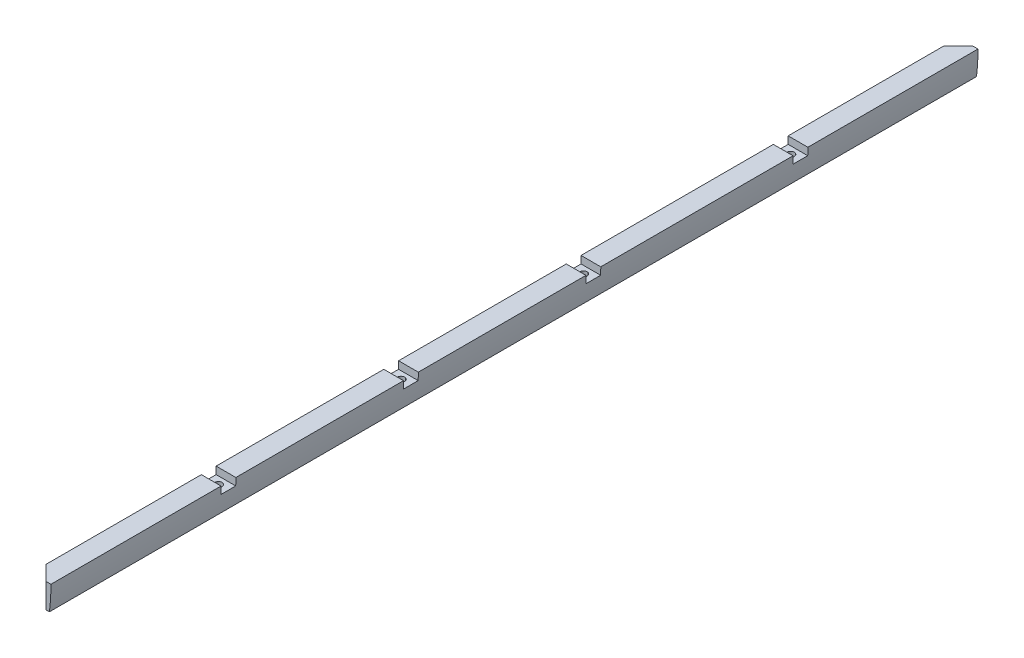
from build123d import *

# Parameters (mm, degrees)
BASE_EXTRUDE_DEPTH  = 1193.8
SKETCH2_W           = 196.875309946
SKETCH2_H           = 19.05
SLOTCUTS_DEPTH      = 9.525
RINGCLEARANCE_DEPTH = 1223.271911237
SKETCH4_R           = 4.7625
CUT_EXTRUDE1_DEPTH  = 1223.061583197


with BuildPart() as part:
    # Sketch1 → Base-Extrude (new body)
    with BuildSketch(Plane.XY):
        with BuildLine():
            Line((234.95, 0), (260.35, 0))
            ThreePointArc((260.35, 0), (259.863738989, -15.904705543), (258.406772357, -31.75))
            Line((258.406772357, -31.75), (234.95, -31.75))
            Line((234.95, -31.75), (234.95, 0))
        make_face()
    extrude(amount=BASE_EXTRUDE_DEPTH)

    # Sketch2 → SlotCuts (cut)
    with BuildSketch(Plane(origin=(0, 0, 0), x_dir=(-1, 0, 0), z_dir=(0, 1, 0))):
        with Locations((-253.960106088, 228.6)):
            Rectangle(SKETCH2_W, SKETCH2_H)
        with Locations((-253.960106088, 495.3)):
            Rectangle(SKETCH2_W, SKETCH2_H)
        with Locations((-253.960106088, 730.25)):
            Rectangle(SKETCH2_W, SKETCH2_H)
        with Locations((-253.960106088, 965.2)):
            Rectangle(SKETCH2_W, SKETCH2_H)
    extrude(amount=-SLOTCUTS_DEPTH, mode=Mode.SUBTRACT)

    # Sketch3 → RingClearance (cut, through all)
    with BuildSketch(Plane(origin=(0, 0, 0), x_dir=(-1, 0, 0), z_dir=(0, 1, 0))):
        Polygon((-254, 1193.8), (-234.95, 1174.75), (-234.95, 1193.8), align=None)
        Polygon((-254, 0), (-234.95, 19.05), (-234.95, 0), align=None)
    extrude(amount=-RINGCLEARANCE_DEPTH, mode=Mode.SUBTRACT)

    # Sketch4 → Cut-Extrude1 (cut, through all)
    with BuildSketch(Plane(origin=(0, -9.525, 0), x_dir=(-1, 0, 0), z_dir=(0, 1, 0))):
        with Locations(Location((-247.475703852, 965.2, 0), (0, 0, 90))):
            Circle(SKETCH4_R)
        with Locations(Location((-247.65, 730.25, 0), (0, 0, 90))):
            Circle(SKETCH4_R)
        with Locations(Location((-247.65, 495.3, 0), (0, 0, 90))):
            Circle(SKETCH4_R)
        with Locations(Location((-247.65, 228.6, 0), (0, 0, 90))):
            Circle(SKETCH4_R)
    extrude(amount=-CUT_EXTRUDE1_DEPTH, mode=Mode.SUBTRACT)


solid = part.part
